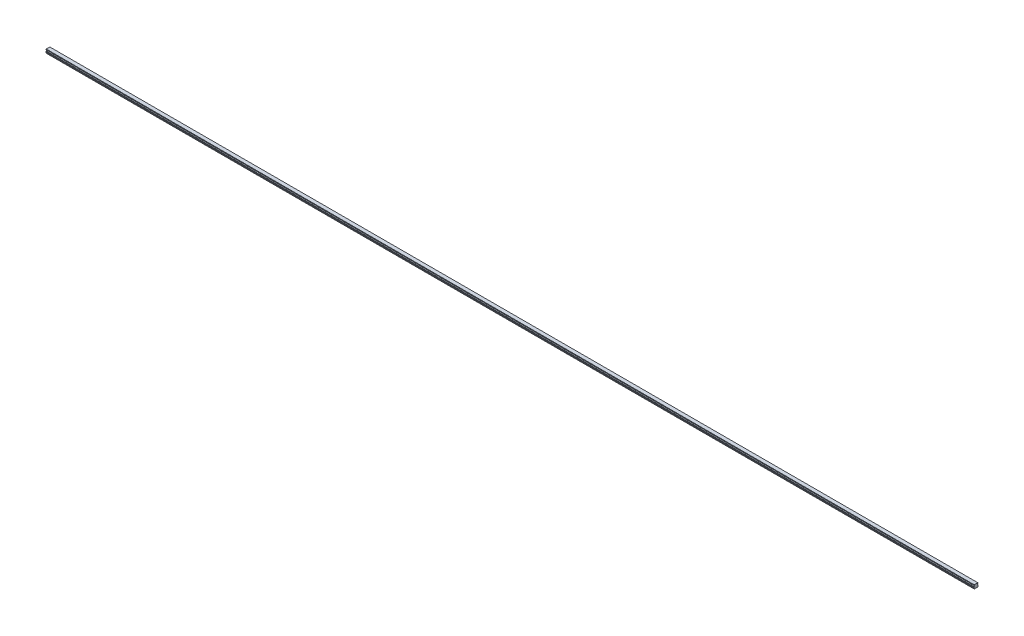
from build123d import *

# Parameters (mm, degrees)
BOSS_EXTRUDE1_DEPTH        = 3420
SKETCH3_R                  = 2.5
SKETCH3_R_2                = 2.1
CUT_EXTRUDE3_DEPTH         = 7
SKETCH3_2_R                = 2.1
CUT_EXTRUDE4_DEPTH         = 9.5
CHAMFER1_SIZE              = 0.4
LPATTERN2_COUNT            = 57
LPATTERN2_PITCH            = 60
CHAMFER1_OF_LPATTERN2_SIZE = 0.4


with BuildPart() as part:
    # Sketch1 → Boss-Extrude1 (new body)
    with BuildSketch(Plane(origin=(0, 0, 0), x_dir=(0, 0, -1), z_dir=(1, 0, 0))):
        with BuildLine():
            Line((6.59, 14), (-6.59, 14))
            Line((-6.59, 14), (-6.59, 13.15))
            Line((-6.59, 13.15), (-6.96, 12.356532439))
            Line((-6.96, 12.356532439), (-6.96, 11.435174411))
            ThreePointArc((-6.96, 11.435174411), (-5.25, 9.5), (-6.96, 7.564825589))
            Line((-6.96, 7.564825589), (-6.96, 6.643467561))
            Line((-6.96, 6.643467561), (-6.59, 5.85))
            Line((-6.59, 5.85), (-7.032116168, 4.2))
            Line((-7.032116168, 4.2), (-7.5, 3.929867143))
            Line((-7.5, 3.929867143), (-7.5, 1.4))
            Line((-7.5, 1.4), (-6.1, 0))
            Line((-6.1, 0), (-3.65, 0))
            Line((-3.65, 0), (-3.25, 0.4))
            Line((-3.25, 0.4), (3.25, 0.4))
            Line((3.25, 0.4), (3.65, 0))
            Line((3.65, 0), (6.1, 0))
            Line((6.1, 0), (7.5, 1.4))
            Line((7.5, 1.4), (7.5, 3.929867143))
            Line((7.5, 3.929867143), (7.032116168, 4.2))
            Line((7.032116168, 4.2), (6.59, 5.85))
            Line((6.59, 5.85), (6.96, 6.643467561))
            Line((6.96, 6.643467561), (6.96, 7.564825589))
            ThreePointArc((6.96, 7.564825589), (5.25, 9.5), (6.96, 11.435174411))
            Line((6.96, 11.435174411), (6.96, 12.356532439))
            Line((6.96, 12.356532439), (6.59, 13.15))
            Line((6.59, 13.15), (6.59, 14))
        make_face()
    extrude(amount=BOSS_EXTRUDE1_DEPTH)

    # Sketch3 → Cut-Extrude3 (cut)
    with BuildSketch(Plane.XZ):
        with Locations(Location((30, 0, 0), (0, 0, 270))):
            Circle(SKETCH3_R)
        with Locations(Location((30, 0, 0), (0, 0, 270))):
            Circle(SKETCH3_R_2, mode=Mode.SUBTRACT)
    cut_extrude3 = extrude(amount=-CUT_EXTRUDE3_DEPTH, mode=Mode.SUBTRACT)

    # Sketch3_2 → Cut-Extrude4 (cut)
    with BuildSketch(Plane.XZ):
        with Locations(Location((30, 0, 0), (0, 0, 270))):
            Circle(SKETCH3_2_R)
    cut_extrude4 = extrude(amount=-CUT_EXTRUDE4_DEPTH, mode=Mode.SUBTRACT)

    # Cut-Extrude5 cone 1 section (on through the dimple's axis) → Cut-Extrude5 (revolve, cut)
    with BuildSketch(Plane(origin=(30, 9.5, 0), x_dir=(0, 0, -1), z_dir=(1, 0, 0))):
        Polygon((0, 0), (2.1, 0), (0, 1.212435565), align=None)
    revolve(axis=Axis((30, 9.5, 0), (0, 1, 0)), mode=Mode.SUBTRACT)

    # Chamfer1
    chamfer1_edges = [part.edges().sort_by_distance(p)[0] for p in [
        (30, 0.4, 2.5),
    ]]
    chamfer(chamfer1_edges, length=CHAMFER1_SIZE)

    # LPattern2: Cut-Extrude3, Cut-Extrude4 ×57
    with Locations(*[(i * LPATTERN2_PITCH, 0, 0) for i in range(1, LPATTERN2_COUNT)]):
        add(cut_extrude3, mode=Mode.SUBTRACT)
        add(cut_extrude4, mode=Mode.SUBTRACT)

    # Chamfer1 of LPattern2
    chamfer1_of_lpattern2_edges = [part.edges().sort_by_distance(p)[0] for p in [
        (90, 0.4, 2.5),
        (150, 0.4, 2.5),
        (210, 0.4, 2.5),
        (270, 0.4, 2.5),
        (330, 0.4, 2.5),
        (390, 0.4, 2.5),
        (450, 0.4, 2.5),
        (510, 0.4, 2.5),
        (570, 0.4, 2.5),
        (630, 0.4, 2.5),
        (690, 0.4, 2.5),
        (750, 0.4, 2.5),
        (810, 0.4, 2.5),
        (870, 0.4, 2.5),
        (930, 0.4, 2.5),
        (990, 0.4, 2.5),
        (1050, 0.4, 2.5),
        (1110, 0.4, 2.5),
        (1170, 0.4, 2.5),
        (1230, 0.4, 2.5),
        (1290, 0.4, 2.5),
        (1350, 0.4, 2.5),
        (1410, 0.4, 2.5),
        (1470, 0.4, 2.5),
        (1530, 0.4, 2.5),
        (1590, 0.4, 2.5),
        (1650, 0.4, 2.5),
        (1710, 0.4, 2.5),
        (1770, 0.4, 2.5),
        (1830, 0.4, 2.5),
        (1890, 0.4, 2.5),
        (1950, 0.4, 2.5),
        (2010, 0.4, 2.5),
        (2070, 0.4, 2.5),
        (2130, 0.4, 2.5),
        (2190, 0.4, 2.5),
        (2250, 0.4, 2.5),
        (2310, 0.4, 2.5),
        (2370, 0.4, 2.5),
        (2430, 0.4, 2.5),
        (2490, 0.4, 2.5),
        (2550, 0.4, 2.5),
        (2610, 0.4, 2.5),
        (2670, 0.4, 2.5),
        (2730, 0.4, 2.5),
        (2790, 0.4, 2.5),
        (2850, 0.4, 2.5),
        (2910, 0.4, 2.5),
        (2970, 0.4, 2.5),
        (3030, 0.4, 2.5),
        (3090, 0.4, 2.5),
        (3150, 0.4, 2.5),
        (3210, 0.4, 2.5),
        (3270, 0.4, 2.5),
        (3330, 0.4, 2.5),
        (3390, 0.4, 2.5),
    ]]
    chamfer(chamfer1_of_lpattern2_edges, length=CHAMFER1_OF_LPATTERN2_SIZE)


solid = part.part
